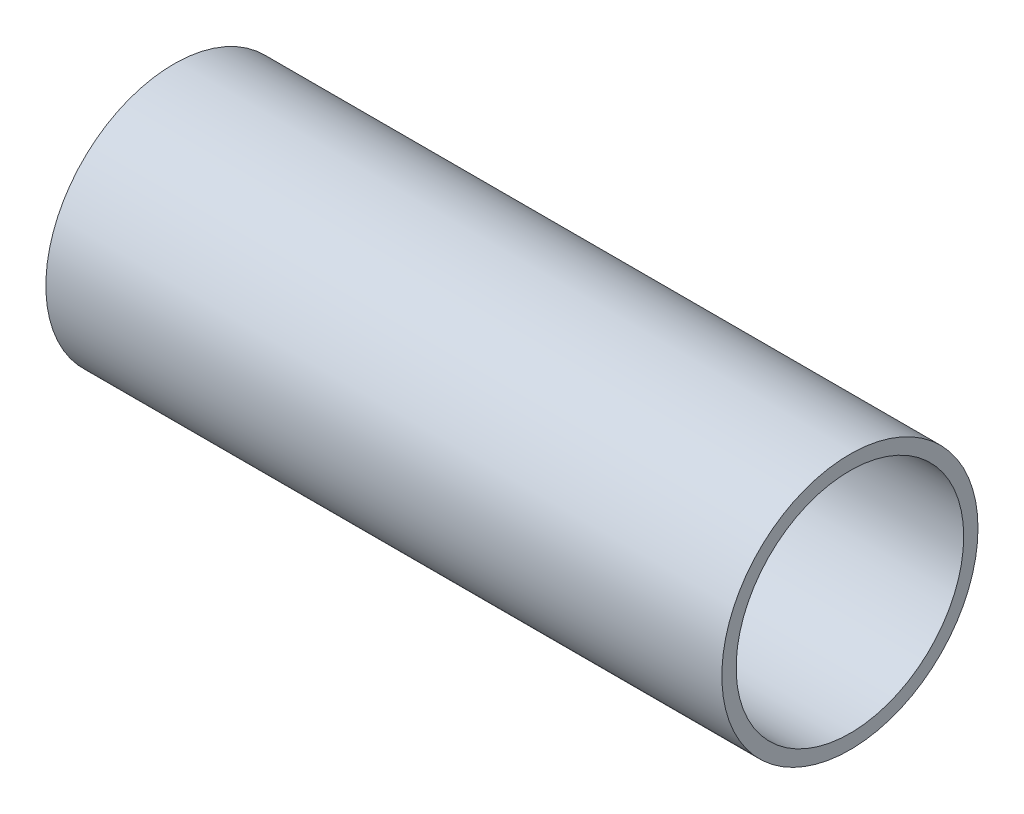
from build123d import *

# Parameters (mm, degrees)
SKETCH1_R           = 57.15
SKETCH1_R_2         = 50.7746
BOSS_EXTRUDE1_DEPTH = 301.625


with BuildPart() as part:
    # Sketch1 → Boss-Extrude1 (new body)
    with BuildSketch(Plane(origin=(0, 0, 0), x_dir=(0, 0, -1), z_dir=(1, 0, 0))):
        Circle(SKETCH1_R)
        Circle(SKETCH1_R_2, mode=Mode.SUBTRACT)
    extrude(amount=BOSS_EXTRUDE1_DEPTH)


solid = part.part
